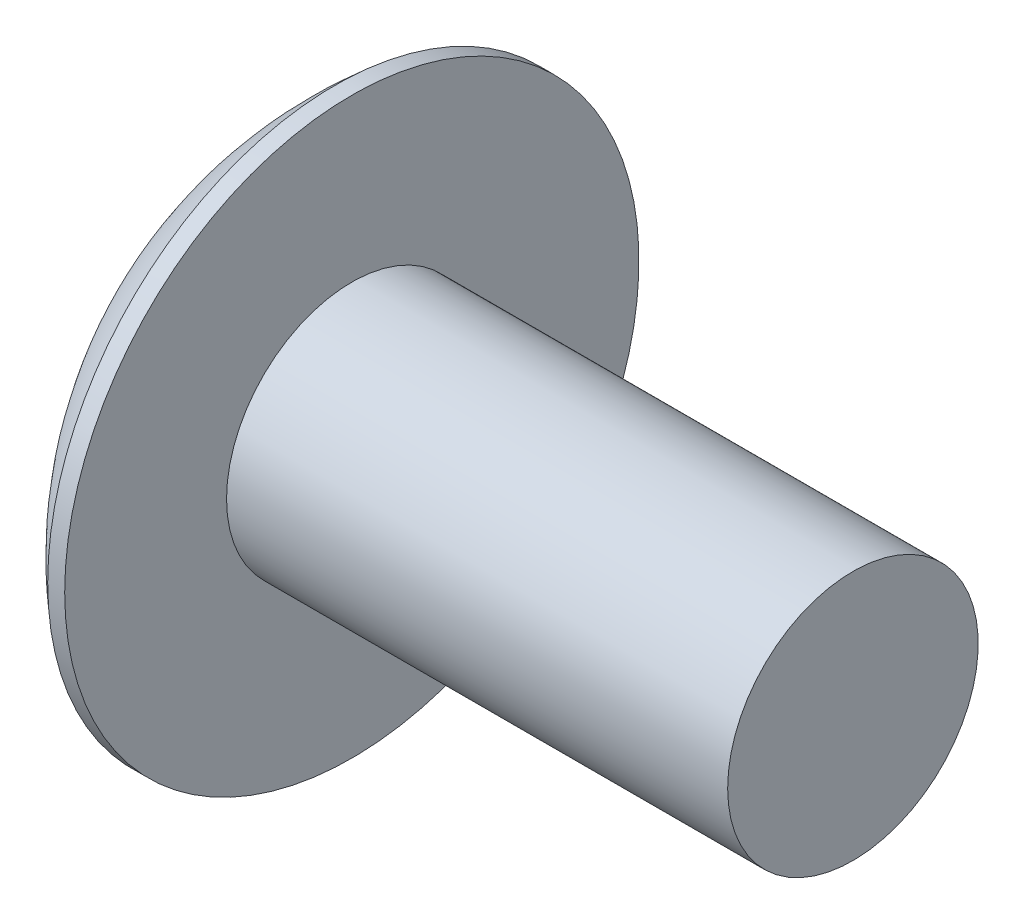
from build123d import *

# Parameters (mm, degrees)
CIRPATTERN1_COUNT = 2
CIRPATTERN1_ANGLE = 90


with BuildPart() as part:
    # BodySke → Base-Revolve (revolve)
    with BuildSketch(Plane.XY, mode=Mode.PRIVATE) as base_revolve_sk:
        with BuildLine():
            Line((3.81, 3.175), (3.81, 7.2771))
            Line((3.81, 7.2771), (3.379315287, 7.2771))
            ThreePointArc((3.379315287, 7.2771), (0.886039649, 4.011731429), (0, 0))
            Line((0, 0), (16.51, 0))
            Line((16.51, 0), (16.51, 3.175))
            Line((16.51, 3.175), (3.81, 3.175))
        make_face()
    revolve(base_revolve_sk.sketch.rotate(Axis((-25.4, 0, 0), (1, 0, 0)), 90), axis=Axis((-25.4, 0, 0), (1, 0, 0)))

    # Sketch3 → Cross section 0
    with BuildSketch(Plane(origin=(0, 0, 0), x_dir=(0, 0, -1), z_dir=(1, 0, 0))):
        with BuildLine():
            Line((0.7239, -4.0767), (-0.7239, -4.0767))
            Line((-0.7239, -4.0767), (-0.7239, 4.0767))
            Line((-0.7239, 4.0767), (0.7239, 4.0767))
            Line((0.7239, 4.0767), (0.7239, -4.0767))
        make_face()
    # Sketch4 → Cross section 1
    with BuildSketch(Plane(origin=(4.6228, 0, 0), x_dir=(0, 0, -1), z_dir=(1, 0, 0))):
        with BuildLine():
            Line((0.36195, -0.36195), (-0.36195, -0.36195))
            Line((-0.36195, -0.36195), (-0.36195, 0.36195))
            Line((-0.36195, 0.36195), (0.36195, 0.36195))
            Line((0.36195, 0.36195), (0.36195, -0.36195))
        make_face()
    cross = loft(mode=Mode.SUBTRACT)

    # CirPattern1: Cross ×2 about axis
    cirpattern1_axis = Axis((0, 0, 0), (1, 0, 0))
    for i in range(1, CIRPATTERN1_COUNT):
        add(cross.rotate(cirpattern1_axis, i * CIRPATTERN1_ANGLE / (CIRPATTERN1_COUNT - 1)), mode=Mode.SUBTRACT)


solid = part.part
